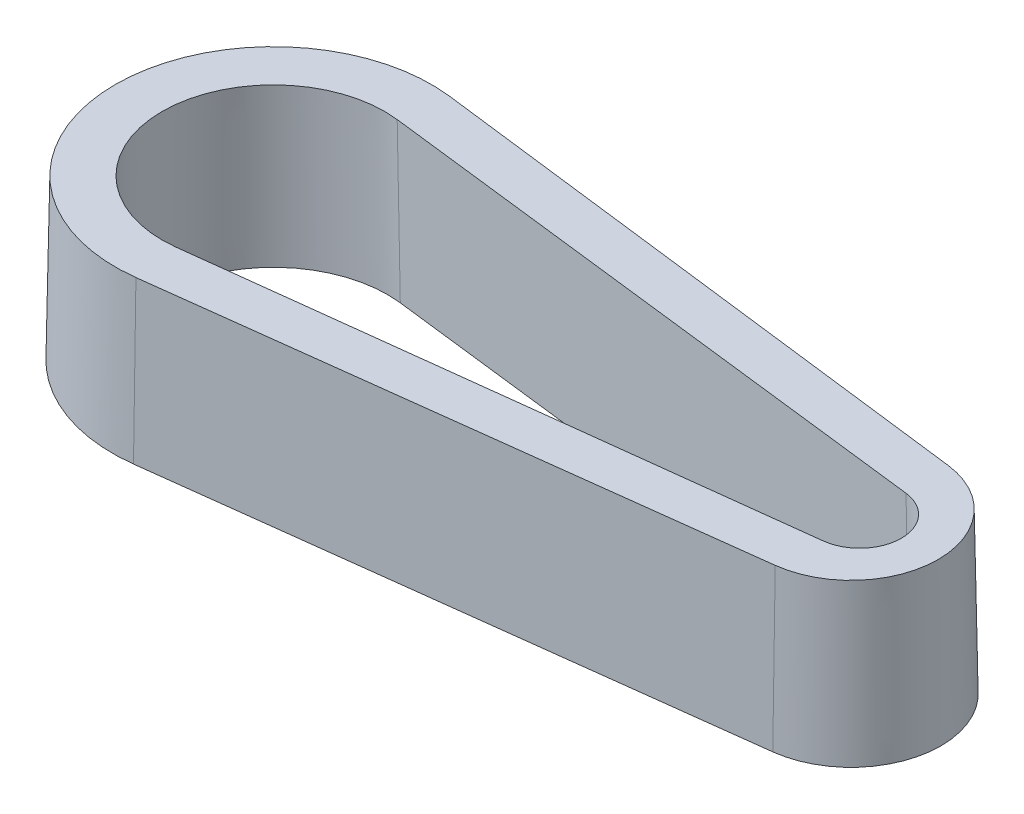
ISO-10303-21;
HEADER;
FILE_DESCRIPTION(('STEP AP214'),'2;1');
FILE_NAME('part.step','',(''),(''),'','','');
FILE_SCHEMA(('AUTOMOTIVE_DESIGN { 1 0 10303 214 1 1 1 1 }'));
ENDSEC;
DATA;
#1=APPLICATION_CONTEXT('core data for automotive mechanical design processes');
#2=APPLICATION_PROTOCOL_DEFINITION('international standard','automotive_design',2000,#1);
#3=PRODUCT_CONTEXT('',#1,'mechanical');
#4=PRODUCT('Part','Part','',(#3));
#5=PRODUCT_RELATED_PRODUCT_CATEGORY('part','',(#4));
#6=PRODUCT_DEFINITION_FORMATION('','',#4);
#7=PRODUCT_DEFINITION_CONTEXT('part definition',#1,'design');
#8=PRODUCT_DEFINITION('design','',#6,#7);
#9=PRODUCT_DEFINITION_SHAPE('','',#8);
#10=(LENGTH_UNIT() NAMED_UNIT(*) SI_UNIT(.MILLI.,.METRE.));
#11=(NAMED_UNIT(*) PLANE_ANGLE_UNIT() SI_UNIT($,.RADIAN.));
#12=(NAMED_UNIT(*) SI_UNIT($,.STERADIAN.) SOLID_ANGLE_UNIT());
#13=UNCERTAINTY_MEASURE_WITH_UNIT(LENGTH_MEASURE(1.E-05),#10,'distance_accuracy_value','');
#14=(GEOMETRIC_REPRESENTATION_CONTEXT(3) GLOBAL_UNCERTAINTY_ASSIGNED_CONTEXT((#13)) GLOBAL_UNIT_ASSIGNED_CONTEXT((#10,
#11,#12)) REPRESENTATION_CONTEXT('',''));
#15=CARTESIAN_POINT('',(0.,0.,0.));
#16=DIRECTION('',(0.,0.,1.));
#17=DIRECTION('',(1.,0.,0.));
#18=AXIS2_PLACEMENT_3D('',#15,#16,#17);
#19=CARTESIAN_POINT('',(0.,11.43,0.));
#20=DIRECTION('',(0.,1.,0.));
#21=DIRECTION('',(0.,0.,1.));
#22=AXIS2_PLACEMENT_3D('',#19,#20,#21);
#23=PLANE('',#22);
#24=CARTESIAN_POINT('',(0.,11.43,0.));
#25=DIRECTION('',(0.,1.,0.));
#26=DIRECTION('',(0.,0.,1.));
#27=AXIS2_PLACEMENT_3D('',#24,#25,#26);
#28=CIRCLE('',#27,11.2939886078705);
#29=CARTESIAN_POINT('',(1.3869810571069,11.43,-11.208499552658));
#30=VERTEX_POINT('',#29);
#31=CARTESIAN_POINT('',(1.3869810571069,11.43,11.208499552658));
#32=VERTEX_POINT('',#31);
#33=EDGE_CURVE('E80',#30,#32,#28,.T.);
#34=ORIENTED_EDGE('',*,*,#33,.T.);
#35=DIRECTION('',(-0.992430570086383,0.,0.12280701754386));
#36=VECTOR('',#35,1.);
#37=CARTESIAN_POINT('',(1.3869810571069,11.43,11.208499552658));
#38=LINE('',#37,#36);
#39=CARTESIAN_POINT('',(42.0269810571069,11.43,6.17955612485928));
#40=VERTEX_POINT('',#39);
#41=EDGE_CURVE('E96',#32,#40,#38,.F.);
#42=ORIENTED_EDGE('',*,*,#41,.T.);
#43=CARTESIAN_POINT('',(41.2623,11.43,0.));
#44=DIRECTION('',(0.,1.,0.));
#45=DIRECTION('',(0.,0.,1.));
#46=AXIS2_PLACEMENT_3D('',#43,#44,#45);
#47=CIRCLE('',#46,6.22668860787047);
#48=CARTESIAN_POINT('',(42.0269810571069,11.43,-6.17955612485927));
#49=VERTEX_POINT('',#48);
#50=EDGE_CURVE('E73',#40,#49,#47,.T.);
#51=ORIENTED_EDGE('',*,*,#50,.T.);
#52=DIRECTION('',(0.992430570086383,0.,0.12280701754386));
#53=VECTOR('',#52,1.);
#54=CARTESIAN_POINT('',(1.3869810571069,11.43,-11.208499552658));
#55=LINE('',#54,#53);
#56=EDGE_CURVE('E39',#49,#30,#55,.F.);
#57=ORIENTED_EDGE('',*,*,#56,.T.);
#58=EDGE_LOOP('',(#34,#42,#51,#57));
#59=FACE_BOUND('',#58,.T.);
#60=DIRECTION('',(0.992911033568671,0.,-0.118859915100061));
#61=VECTOR('',#60,1.);
#62=CARTESIAN_POINT('',(0.945398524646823,11.43,7.89750375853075));
#63=LINE('',#62,#61);
#64=CARTESIAN_POINT('',(0.945398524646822,11.43,7.89750375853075));
#65=VERTEX_POINT('',#64);
#66=CARTESIAN_POINT('',(42.2382663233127,11.43,2.95439546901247));
#67=VERTEX_POINT('',#66);
#68=EDGE_CURVE('E122',#65,#67,#63,.T.);
#69=ORIENTED_EDGE('',*,*,#68,.F.);
#70=CARTESIAN_POINT('',(0.,11.43,0.));
#71=DIRECTION('',(0.,1.,0.));
#72=DIRECTION('',(0.,0.,1.));
#73=AXIS2_PLACEMENT_3D('',#70,#71,#72);
#74=CIRCLE('',#73,7.95388860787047);
#75=CARTESIAN_POINT('',(0.945398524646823,11.43,-7.89750375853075));
#76=VERTEX_POINT('',#75);
#77=EDGE_CURVE('E119',#76,#65,#74,.T.);
#78=ORIENTED_EDGE('',*,*,#77,.F.);
#79=DIRECTION('',(-0.992911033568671,0.,-0.118859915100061));
#80=VECTOR('',#79,1.);
#81=CARTESIAN_POINT('',(0.945398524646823,11.43,-7.89750375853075));
#82=LINE('',#81,#80);
#83=CARTESIAN_POINT('',(42.2382663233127,11.43,-2.95439546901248));
#84=VERTEX_POINT('',#83);
#85=EDGE_CURVE('E108',#84,#76,#82,.T.);
#86=ORIENTED_EDGE('',*,*,#85,.F.);
#87=CARTESIAN_POINT('',(41.8846,11.43,0.));
#88=DIRECTION('',(0.,1.,0.));
#89=DIRECTION('',(0.,0.,1.));
#90=AXIS2_PLACEMENT_3D('',#87,#88,#89);
#91=CIRCLE('',#90,2.97548860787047);
#92=EDGE_CURVE('E118',#67,#84,#91,.T.);
#93=ORIENTED_EDGE('',*,*,#92,.F.);
#94=EDGE_LOOP('',(#69,#78,#86,#93));
#95=FACE_BOUND('',#94,.T.);
#96=ADVANCED_FACE('F35',(#59,#95),#23,.T.);
#97=CARTESIAN_POINT('',(0.,0.,0.));
#98=DIRECTION('',(0.,1.,0.));
#99=DIRECTION('',(0.,0.,1.));
#100=AXIS2_PLACEMENT_3D('',#97,#98,#99);
#101=PLANE('',#100);
#102=CARTESIAN_POINT('',(0.,0.,0.));
#103=DIRECTION('',(0.,1.,0.));
#104=DIRECTION('',(0.,0.,1.));
#105=AXIS2_PLACEMENT_3D('',#102,#103,#104);
#106=CIRCLE('',#105,11.4935);
#107=CARTESIAN_POINT('',(1.41148245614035,0.,-11.4065007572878));
#108=VERTEX_POINT('',#107);
#109=CARTESIAN_POINT('',(1.41148245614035,0.,11.4065007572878));
#110=VERTEX_POINT('',#109);
#111=EDGE_CURVE('E112',#108,#110,#106,.T.);
#112=ORIENTED_EDGE('',*,*,#111,.F.);
#113=DIRECTION('',(-0.992430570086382,0.,-0.12280701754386));
#114=VECTOR('',#113,1.);
#115=CARTESIAN_POINT('',(1.41148245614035,0.,-11.4065007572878));
#116=LINE('',#115,#114);
#117=CARTESIAN_POINT('',(42.0514824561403,0.,-6.37755732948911));
#118=VERTEX_POINT('',#117);
#119=EDGE_CURVE('E89',#118,#108,#116,.T.);
#120=ORIENTED_EDGE('',*,*,#119,.F.);
#121=CARTESIAN_POINT('',(41.2623,0.,0.));
#122=DIRECTION('',(0.,1.,0.));
#123=DIRECTION('',(0.,0.,1.));
#124=AXIS2_PLACEMENT_3D('',#121,#122,#123);
#125=CIRCLE('',#124,6.4262);
#126=CARTESIAN_POINT('',(42.0514824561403,0.,6.37755732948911));
#127=VERTEX_POINT('',#126);
#128=EDGE_CURVE('E99',#127,#118,#125,.T.);
#129=ORIENTED_EDGE('',*,*,#128,.F.);
#130=DIRECTION('',(0.992430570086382,0.,-0.12280701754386));
#131=VECTOR('',#130,1.);
#132=CARTESIAN_POINT('',(1.41148245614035,0.,11.4065007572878));
#133=LINE('',#132,#131);
#134=EDGE_CURVE('E129',#110,#127,#133,.T.);
#135=ORIENTED_EDGE('',*,*,#134,.F.);
#136=EDGE_LOOP('',(#112,#120,#129,#135));
#137=FACE_BOUND('',#136,.T.);
#138=CARTESIAN_POINT('',(0.,0.,0.));
#139=DIRECTION('',(0.,1.,0.));
#140=DIRECTION('',(0.,0.,1.));
#141=AXIS2_PLACEMENT_3D('',#138,#139,#140);
#142=CIRCLE('',#141,8.1534);
#143=CARTESIAN_POINT('',(0.969112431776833,0.,-8.0956008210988));
#144=VERTEX_POINT('',#143);
#145=CARTESIAN_POINT('',(0.969112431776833,0.,8.0956008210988));
#146=VERTEX_POINT('',#145);
#147=EDGE_CURVE('E141',#144,#146,#142,.T.);
#148=ORIENTED_EDGE('',*,*,#147,.T.);
#149=DIRECTION('',(0.992911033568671,0.,-0.118859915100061));
#150=VECTOR('',#149,1.);
#151=CARTESIAN_POINT('',(0.969112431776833,0.,8.0956008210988));
#152=LINE('',#151,#150);
#153=CARTESIAN_POINT('',(42.2619802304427,0.,3.15249253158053));
#154=VERTEX_POINT('',#153);
#155=EDGE_CURVE('E138',#146,#154,#152,.T.);
#156=ORIENTED_EDGE('',*,*,#155,.T.);
#157=CARTESIAN_POINT('',(41.8846,0.,0.));
#158=DIRECTION('',(0.,1.,0.));
#159=DIRECTION('',(0.,0.,1.));
#160=AXIS2_PLACEMENT_3D('',#157,#158,#159);
#161=CIRCLE('',#160,3.175);
#162=CARTESIAN_POINT('',(42.2619802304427,0.,-3.15249253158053));
#163=VERTEX_POINT('',#162);
#164=EDGE_CURVE('E135',#154,#163,#161,.T.);
#165=ORIENTED_EDGE('',*,*,#164,.T.);
#166=DIRECTION('',(-0.992911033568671,0.,-0.118859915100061));
#167=VECTOR('',#166,1.);
#168=CARTESIAN_POINT('',(0.969112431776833,0.,-8.0956008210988));
#169=LINE('',#168,#167);
#170=EDGE_CURVE('E123',#163,#144,#169,.T.);
#171=ORIENTED_EDGE('',*,*,#170,.T.);
#172=EDGE_LOOP('',(#148,#156,#165,#171));
#173=FACE_BOUND('',#172,.T.);
#174=ADVANCED_FACE('F145',(#137,#173),#101,.F.);
#175=CARTESIAN_POINT('',(0.,0.,0.));
#176=DIRECTION('',(0.,-1.,0.));
#177=DIRECTION('',(0.,0.,1.));
#178=AXIS2_PLACEMENT_3D('',#175,#176,#177);
#179=CONICAL_SURFACE('',#178,11.4935,0.0174532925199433);
#180=ORIENTED_EDGE('',*,*,#111,.T.);
#181=DIRECTION('',(0.00214327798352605,-0.999847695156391,0.0173203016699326));
#182=VECTOR('',#181,1.);
#183=CARTESIAN_POINT('',(1.41148245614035,0.,11.4065007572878));
#184=LINE('',#183,#182);
#185=EDGE_CURVE('E11',#32,#110,#184,.T.);
#186=ORIENTED_EDGE('',*,*,#185,.F.);
#187=ORIENTED_EDGE('',*,*,#33,.F.);
#188=DIRECTION('',(0.00214327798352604,-0.999847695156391,-0.0173203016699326));
#189=VECTOR('',#188,1.);
#190=CARTESIAN_POINT('',(1.41148245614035,0.,-11.4065007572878));
#191=LINE('',#190,#189);
#192=EDGE_CURVE('E84',#30,#108,#191,.T.);
#193=ORIENTED_EDGE('',*,*,#192,.T.);
#194=EDGE_LOOP('',(#180,#186,#187,#193));
#195=FACE_BOUND('',#194,.T.);
#196=ADVANCED_FACE('F95',(#195),#179,.T.);
#197=CARTESIAN_POINT('',(1.41148245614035,0.,11.4065007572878));
#198=DIRECTION('',(0.122788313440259,0.0174524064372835,0.992279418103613));
#199=DIRECTION('',(0.992430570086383,0.,-0.12280701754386));
#200=AXIS2_PLACEMENT_3D('',#197,#198,#199);
#201=PLANE('',#200);
#202=ORIENTED_EDGE('',*,*,#134,.T.);
#203=DIRECTION('',(0.00214327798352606,-0.999847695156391,0.0173203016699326));
#204=VECTOR('',#203,1.);
#205=CARTESIAN_POINT('',(42.0514824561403,0.,6.37755732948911));
#206=LINE('',#205,#204);
#207=EDGE_CURVE('E45',#40,#127,#206,.T.);
#208=ORIENTED_EDGE('',*,*,#207,.F.);
#209=ORIENTED_EDGE('',*,*,#41,.F.);
#210=ORIENTED_EDGE('',*,*,#185,.T.);
#211=EDGE_LOOP('',(#202,#208,#209,#210));
#212=FACE_BOUND('',#211,.T.);
#213=ADVANCED_FACE('F37',(#212),#201,.T.);
#214=CARTESIAN_POINT('',(41.2623,0.,0.));
#215=DIRECTION('',(0.,-1.,0.));
#216=DIRECTION('',(0.,0.,1.));
#217=AXIS2_PLACEMENT_3D('',#214,#215,#216);
#218=CONICAL_SURFACE('',#217,6.4262,0.0174532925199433);
#219=ORIENTED_EDGE('',*,*,#128,.T.);
#220=DIRECTION('',(0.00214327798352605,-0.999847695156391,-0.0173203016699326));
#221=VECTOR('',#220,1.);
#222=CARTESIAN_POINT('',(42.0514824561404,0.,-6.37755732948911));
#223=LINE('',#222,#221);
#224=EDGE_CURVE('E93',#49,#118,#223,.T.);
#225=ORIENTED_EDGE('',*,*,#224,.F.);
#226=ORIENTED_EDGE('',*,*,#50,.F.);
#227=ORIENTED_EDGE('',*,*,#207,.T.);
#228=EDGE_LOOP('',(#219,#225,#226,#227));
#229=FACE_BOUND('',#228,.T.);
#230=ADVANCED_FACE('F180',(#229),#218,.T.);
#231=CARTESIAN_POINT('',(1.41148245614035,0.,-11.4065007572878));
#232=DIRECTION('',(0.122788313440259,0.0174524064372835,-0.992279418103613));
#233=DIRECTION('',(-0.992430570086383,0.,-0.12280701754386));
#234=AXIS2_PLACEMENT_3D('',#231,#232,#233);
#235=PLANE('',#234);
#236=ORIENTED_EDGE('',*,*,#119,.T.);
#237=ORIENTED_EDGE('',*,*,#192,.F.);
#238=ORIENTED_EDGE('',*,*,#56,.F.);
#239=ORIENTED_EDGE('',*,*,#224,.T.);
#240=EDGE_LOOP('',(#236,#237,#238,#239));
#241=FACE_BOUND('',#240,.T.);
#242=ADVANCED_FACE('F87',(#241),#235,.T.);
#243=CARTESIAN_POINT('',(0.,0.,0.));
#244=DIRECTION('',(0.,-1.,0.));
#245=DIRECTION('',(0.,0.,1.));
#246=AXIS2_PLACEMENT_3D('',#243,#244,#245);
#247=CONICAL_SURFACE('',#246,8.1534,0.0174532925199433);
#248=ORIENTED_EDGE('',*,*,#147,.F.);
#249=DIRECTION('',(-0.00207439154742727,0.999847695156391,0.0173286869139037));
#250=VECTOR('',#249,1.);
#251=CARTESIAN_POINT('',(0.969112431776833,0.,-8.0956008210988));
#252=LINE('',#251,#250);
#253=EDGE_CURVE('E105',#76,#144,#252,.F.);
#254=ORIENTED_EDGE('',*,*,#253,.F.);
#255=ORIENTED_EDGE('',*,*,#77,.T.);
#256=DIRECTION('',(-0.00207439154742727,0.999847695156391,-0.0173286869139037));
#257=VECTOR('',#256,1.);
#258=CARTESIAN_POINT('',(0.969112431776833,0.,8.0956008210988));
#259=LINE('',#258,#257);
#260=EDGE_CURVE('E109',#65,#146,#259,.F.);
#261=ORIENTED_EDGE('',*,*,#260,.T.);
#262=EDGE_LOOP('',(#248,#254,#255,#261));
#263=FACE_BOUND('',#262,.T.);
#264=ADVANCED_FACE('F151',(#263),#247,.F.);
#265=CARTESIAN_POINT('',(0.969112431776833,0.,8.0956008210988));
#266=DIRECTION('',(-0.11884181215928,-0.0174524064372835,-0.992759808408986));
#267=DIRECTION('',(-0.992911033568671,0.,0.118859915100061));
#268=AXIS2_PLACEMENT_3D('',#265,#266,#267);
#269=PLANE('',#268);
#270=ORIENTED_EDGE('',*,*,#155,.F.);
#271=ORIENTED_EDGE('',*,*,#260,.F.);
#272=ORIENTED_EDGE('',*,*,#68,.T.);
#273=DIRECTION('',(-0.00207439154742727,0.999847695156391,-0.0173286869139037));
#274=VECTOR('',#273,1.);
#275=CARTESIAN_POINT('',(42.2619802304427,0.,3.15249253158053));
#276=LINE('',#275,#274);
#277=EDGE_CURVE('E113',#67,#154,#276,.F.);
#278=ORIENTED_EDGE('',*,*,#277,.T.);
#279=EDGE_LOOP('',(#270,#271,#272,#278));
#280=FACE_BOUND('',#279,.T.);
#281=ADVANCED_FACE('F163',(#280),#269,.T.);
#282=CARTESIAN_POINT('',(41.8846,0.,0.));
#283=DIRECTION('',(0.,-1.,0.));
#284=DIRECTION('',(0.,0.,1.));
#285=AXIS2_PLACEMENT_3D('',#282,#283,#284);
#286=CONICAL_SURFACE('',#285,3.175,0.0174532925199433);
#287=ORIENTED_EDGE('',*,*,#164,.F.);
#288=ORIENTED_EDGE('',*,*,#277,.F.);
#289=ORIENTED_EDGE('',*,*,#92,.T.);
#290=DIRECTION('',(-0.00207439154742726,0.999847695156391,0.0173286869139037));
#291=VECTOR('',#290,1.);
#292=CARTESIAN_POINT('',(42.2619802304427,0.,-3.15249253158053));
#293=LINE('',#292,#291);
#294=EDGE_CURVE('E54',#84,#163,#293,.F.);
#295=ORIENTED_EDGE('',*,*,#294,.T.);
#296=EDGE_LOOP('',(#287,#288,#289,#295));
#297=FACE_BOUND('',#296,.T.);
#298=ADVANCED_FACE('F168',(#297),#286,.F.);
#299=CARTESIAN_POINT('',(0.969112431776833,0.,-8.0956008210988));
#300=DIRECTION('',(-0.11884181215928,-0.0174524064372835,0.992759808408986));
#301=DIRECTION('',(0.992911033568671,0.,0.118859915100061));
#302=AXIS2_PLACEMENT_3D('',#299,#300,#301);
#303=PLANE('',#302);
#304=ORIENTED_EDGE('',*,*,#170,.F.);
#305=ORIENTED_EDGE('',*,*,#294,.F.);
#306=ORIENTED_EDGE('',*,*,#85,.T.);
#307=ORIENTED_EDGE('',*,*,#253,.T.);
#308=EDGE_LOOP('',(#304,#305,#306,#307));
#309=FACE_BOUND('',#308,.T.);
#310=ADVANCED_FACE('F154',(#309),#303,.T.);
#311=CLOSED_SHELL('',(#96,#174,#196,#213,#230,#242,#264,#281,#298,#310));
#312=MANIFOLD_SOLID_BREP('B2',#311);
#313=ADVANCED_BREP_SHAPE_REPRESENTATION('',(#18,#312),#14);
#314=SHAPE_DEFINITION_REPRESENTATION(#9,#313);
ENDSEC;
END-ISO-10303-21;
